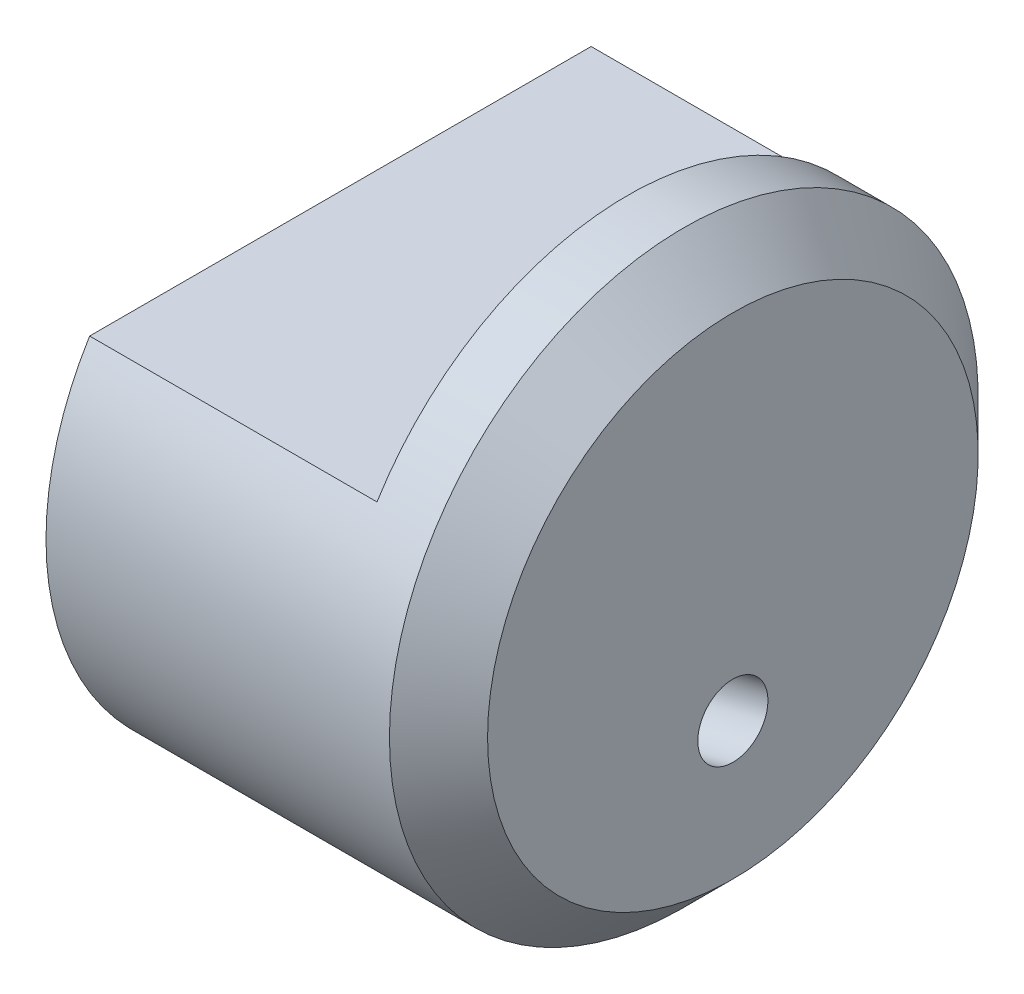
ISO-10303-21;
HEADER;
FILE_DESCRIPTION(('STEP AP214'),'2;1');
FILE_NAME('part.step','',(''),(''),'','','');
FILE_SCHEMA(('AUTOMOTIVE_DESIGN { 1 0 10303 214 1 1 1 1 }'));
ENDSEC;
DATA;
#1=APPLICATION_CONTEXT('core data for automotive mechanical design processes');
#2=APPLICATION_PROTOCOL_DEFINITION('international standard','automotive_design',2000,#1);
#3=PRODUCT_CONTEXT('',#1,'mechanical');
#4=PRODUCT('Part','Part','',(#3));
#5=PRODUCT_RELATED_PRODUCT_CATEGORY('part','',(#4));
#6=PRODUCT_DEFINITION_FORMATION('','',#4);
#7=PRODUCT_DEFINITION_CONTEXT('part definition',#1,'design');
#8=PRODUCT_DEFINITION('design','',#6,#7);
#9=PRODUCT_DEFINITION_SHAPE('','',#8);
#10=(LENGTH_UNIT() NAMED_UNIT(*) SI_UNIT(.MILLI.,.METRE.));
#11=(NAMED_UNIT(*) PLANE_ANGLE_UNIT() SI_UNIT($,.RADIAN.));
#12=(NAMED_UNIT(*) SI_UNIT($,.STERADIAN.) SOLID_ANGLE_UNIT());
#13=UNCERTAINTY_MEASURE_WITH_UNIT(LENGTH_MEASURE(1.E-05),#10,'distance_accuracy_value','');
#14=(GEOMETRIC_REPRESENTATION_CONTEXT(3) GLOBAL_UNCERTAINTY_ASSIGNED_CONTEXT((#13)) GLOBAL_UNIT_ASSIGNED_CONTEXT((#10,
#11,#12)) REPRESENTATION_CONTEXT('',''));
#15=CARTESIAN_POINT('',(0.,0.,0.));
#16=DIRECTION('',(0.,0.,1.));
#17=DIRECTION('',(1.,0.,0.));
#18=AXIS2_PLACEMENT_3D('',#15,#16,#17);
#19=CARTESIAN_POINT('',(0.,0.,0.));
#20=DIRECTION('',(1.,0.,0.));
#21=DIRECTION('',(0.,0.,-1.));
#22=AXIS2_PLACEMENT_3D('',#19,#20,#21);
#23=PLANE('',#22);
#24=CARTESIAN_POINT('',(0.,0.,0.));
#25=DIRECTION('',(-1.,0.,0.));
#26=DIRECTION('',(0.,0.,1.));
#27=AXIS2_PLACEMENT_3D('',#24,#25,#26);
#28=CIRCLE('',#27,3.5);
#29=CARTESIAN_POINT('',(0.,0.,3.5));
#30=VERTEX_POINT('',#29);
#31=EDGE_CURVE('E61',#30,#30,#28,.T.);
#32=ORIENTED_EDGE('',*,*,#31,.F.);
#33=EDGE_LOOP('',(#32));
#34=FACE_BOUND('',#33,.T.);
#35=CARTESIAN_POINT('',(0.,-1.54262279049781,0.));
#36=DIRECTION('',(1.,0.,0.));
#37=DIRECTION('',(0.,1.,0.));
#38=AXIS2_PLACEMENT_3D('',#35,#36,#37);
#39=ELLIPSE('',#38,0.514207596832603,0.5);
#40=CARTESIAN_POINT('',(0.,-1.02841519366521,0.));
#41=VERTEX_POINT('',#40);
#42=EDGE_CURVE('E34',#41,#41,#39,.F.);
#43=ORIENTED_EDGE('',*,*,#42,.T.);
#44=EDGE_LOOP('',(#43));
#45=FACE_BOUND('',#44,.T.);
#46=ADVANCED_FACE('F31',(#34,#45),#23,.T.);
#47=CARTESIAN_POINT('',(-0.700000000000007,0.,0.));
#48=DIRECTION('',(-1.,0.,0.));
#49=DIRECTION('',(0.,0.,1.));
#50=AXIS2_PLACEMENT_3D('',#47,#48,#49);
#51=CONICAL_SURFACE('',#50,4.2,0.785398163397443);
#52=ORIENTED_EDGE('',*,*,#31,.T.);
#53=EDGE_LOOP('',(#52));
#54=FACE_BOUND('',#53,.T.);
#55=CARTESIAN_POINT('',(-0.700000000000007,0.,0.));
#56=DIRECTION('',(-1.,0.,0.));
#57=DIRECTION('',(0.,0.,1.));
#58=AXIS2_PLACEMENT_3D('',#55,#56,#57);
#59=CIRCLE('',#58,4.2);
#60=CARTESIAN_POINT('',(-0.700000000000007,0.,4.2));
#61=VERTEX_POINT('',#60);
#62=EDGE_CURVE('E71',#61,#61,#59,.T.);
#63=ORIENTED_EDGE('',*,*,#62,.F.);
#64=EDGE_LOOP('',(#63));
#65=FACE_BOUND('',#64,.T.);
#66=ADVANCED_FACE('F83',(#54,#65),#51,.T.);
#67=CARTESIAN_POINT('',(-1.5,0.,0.));
#68=DIRECTION('',(-1.,0.,0.));
#69=DIRECTION('',(0.,0.,1.));
#70=AXIS2_PLACEMENT_3D('',#67,#68,#69);
#71=CYLINDRICAL_SURFACE('',#70,4.2);
#72=DIRECTION('',(-1.,0.,0.));
#73=VECTOR('',#72,1.);
#74=CARTESIAN_POINT('',(-1.5,2.2,3.57770876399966));
#75=LINE('',#74,#73);
#76=CARTESIAN_POINT('',(-5.6,2.2,3.57770876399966));
#77=VERTEX_POINT('',#76);
#78=CARTESIAN_POINT('',(-1.5,2.2,3.57770876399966));
#79=VERTEX_POINT('',#78);
#80=EDGE_CURVE('E51',#77,#79,#75,.F.);
#81=ORIENTED_EDGE('',*,*,#80,.F.);
#82=CARTESIAN_POINT('',(-5.6,0.,0.));
#83=DIRECTION('',(-1.,0.,0.));
#84=DIRECTION('',(0.,0.,1.));
#85=AXIS2_PLACEMENT_3D('',#82,#83,#84);
#86=CIRCLE('',#85,4.2);
#87=CARTESIAN_POINT('',(-5.6,2.2,-3.57770876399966));
#88=VERTEX_POINT('',#87);
#89=EDGE_CURVE('E66',#88,#77,#86,.T.);
#90=ORIENTED_EDGE('',*,*,#89,.F.);
#91=DIRECTION('',(-1.,0.,0.));
#92=VECTOR('',#91,1.);
#93=CARTESIAN_POINT('',(-1.5,2.2,-3.57770876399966));
#94=LINE('',#93,#92);
#95=CARTESIAN_POINT('',(-1.5,2.2,-3.57770876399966));
#96=VERTEX_POINT('',#95);
#97=EDGE_CURVE('E46',#96,#88,#94,.T.);
#98=ORIENTED_EDGE('',*,*,#97,.F.);
#99=CARTESIAN_POINT('',(-1.5,0.,0.));
#100=DIRECTION('',(-1.,0.,0.));
#101=DIRECTION('',(0.,0.,1.));
#102=AXIS2_PLACEMENT_3D('',#99,#100,#101);
#103=CIRCLE('',#102,4.2);
#104=EDGE_CURVE('E11',#96,#79,#103,.F.);
#105=ORIENTED_EDGE('',*,*,#104,.T.);
#106=EDGE_LOOP('',(#81,#90,#98,#105));
#107=FACE_BOUND('',#106,.T.);
#108=ORIENTED_EDGE('',*,*,#62,.T.);
#109=EDGE_LOOP('',(#108));
#110=FACE_BOUND('',#109,.T.);
#111=ADVANCED_FACE('F64',(#107,#110),#71,.T.);
#112=CARTESIAN_POINT('',(-5.6,-4.2,0.));
#113=DIRECTION('',(-1.,0.,0.));
#114=DIRECTION('',(0.,0.,1.));
#115=AXIS2_PLACEMENT_3D('',#112,#113,#114);
#116=PLANE('',#115);
#117=DIRECTION('',(0.,0.,1.));
#118=VECTOR('',#117,1.);
#119=CARTESIAN_POINT('',(-5.6,2.2,0.));
#120=LINE('',#119,#118);
#121=EDGE_CURVE('E39',#88,#77,#120,.T.);
#122=ORIENTED_EDGE('',*,*,#121,.F.);
#123=ORIENTED_EDGE('',*,*,#89,.T.);
#124=EDGE_LOOP('',(#122,#123));
#125=FACE_BOUND('',#124,.T.);
#126=CARTESIAN_POINT('',(-5.6,0.,0.));
#127=DIRECTION('',(-1.,0.,0.));
#128=DIRECTION('',(0.,0.,1.));
#129=AXIS2_PLACEMENT_3D('',#126,#127,#128);
#130=CIRCLE('',#129,0.750000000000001);
#131=CARTESIAN_POINT('',(-5.6,0.,0.750000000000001));
#132=VERTEX_POINT('',#131);
#133=EDGE_CURVE('E72',#132,#132,#130,.T.);
#134=ORIENTED_EDGE('',*,*,#133,.F.);
#135=EDGE_LOOP('',(#134));
#136=FACE_BOUND('',#135,.T.);
#137=ADVANCED_FACE('F69',(#125,#136),#116,.T.);
#138=CARTESIAN_POINT('',(-1.5,0.,0.));
#139=DIRECTION('',(-1.,0.,0.));
#140=DIRECTION('',(0.,0.,1.));
#141=AXIS2_PLACEMENT_3D('',#138,#139,#140);
#142=CYLINDRICAL_SURFACE('',#141,0.750000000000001);
#143=ORIENTED_EDGE('',*,*,#133,.T.);
#144=EDGE_LOOP('',(#143));
#145=FACE_BOUND('',#144,.T.);
#146=CARTESIAN_POINT('',(-1.5,0.,0.));
#147=DIRECTION('',(-1.,0.,0.));
#148=DIRECTION('',(0.,0.,1.));
#149=AXIS2_PLACEMENT_3D('',#146,#147,#148);
#150=CIRCLE('',#149,0.750000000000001);
#151=CARTESIAN_POINT('',(-1.5,0.,0.750000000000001));
#152=VERTEX_POINT('',#151);
#153=EDGE_CURVE('E67',#152,#152,#150,.T.);
#154=ORIENTED_EDGE('',*,*,#153,.F.);
#155=EDGE_LOOP('',(#154));
#156=FACE_BOUND('',#155,.T.);
#157=ADVANCED_FACE('F104',(#145,#156),#142,.F.);
#158=CARTESIAN_POINT('',(-1.5,-0.750000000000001,0.));
#159=DIRECTION('',(-1.,0.,0.));
#160=DIRECTION('',(0.,0.,1.));
#161=AXIS2_PLACEMENT_3D('',#158,#159,#160);
#162=PLANE('',#161);
#163=ORIENTED_EDGE('',*,*,#153,.T.);
#164=EDGE_LOOP('',(#163));
#165=FACE_BOUND('',#164,.T.);
#166=ADVANCED_FACE('F102',(#165),#162,.T.);
#167=CARTESIAN_POINT('',(-1.5,2.2,-4.60626173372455));
#168=DIRECTION('',(0.,-1.,0.));
#169=DIRECTION('',(0.,0.,-1.));
#170=AXIS2_PLACEMENT_3D('',#167,#168,#169);
#171=PLANE('',#170);
#172=ORIENTED_EDGE('',*,*,#80,.T.);
#173=DIRECTION('',(0.,0.,1.));
#174=VECTOR('',#173,1.);
#175=CARTESIAN_POINT('',(-1.5,2.2,-4.60626173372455));
#176=LINE('',#175,#174);
#177=EDGE_CURVE('E91',#96,#79,#176,.T.);
#178=ORIENTED_EDGE('',*,*,#177,.F.);
#179=ORIENTED_EDGE('',*,*,#97,.T.);
#180=ORIENTED_EDGE('',*,*,#121,.T.);
#181=EDGE_LOOP('',(#172,#178,#179,#180));
#182=FACE_BOUND('',#181,.T.);
#183=ADVANCED_FACE('F57',(#182),#171,.F.);
#184=CARTESIAN_POINT('',(-1.5,2.2,4.60626173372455));
#185=DIRECTION('',(-1.,0.,0.));
#186=DIRECTION('',(0.,0.,1.));
#187=AXIS2_PLACEMENT_3D('',#184,#185,#186);
#188=PLANE('',#187);
#189=ORIENTED_EDGE('',*,*,#177,.T.);
#190=ORIENTED_EDGE('',*,*,#104,.F.);
#191=EDGE_LOOP('',(#189,#190));
#192=FACE_BOUND('',#191,.T.);
#193=ADVANCED_FACE('F141',(#192),#188,.T.);
#194=CARTESIAN_POINT('',(-4.60891854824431,-2.6491262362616,0.));
#195=DIRECTION('',(0.972369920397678,0.233445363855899,0.));
#196=DIRECTION('',(-0.233445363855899,0.972369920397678,0.));
#197=AXIS2_PLACEMENT_3D('',#194,#195,#196);
#198=CYLINDRICAL_SURFACE('',#197,0.5);
#199=ORIENTED_EDGE('',*,*,#42,.F.);
#200=EDGE_LOOP('',(#199));
#201=FACE_BOUND('',#200,.T.);
#202=CARTESIAN_POINT('',(-4.60891854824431,-2.6491262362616,0.));
#203=DIRECTION('',(-0.972369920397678,-0.233445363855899,0.));
#204=DIRECTION('',(0.233445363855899,-0.972369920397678,0.));
#205=AXIS2_PLACEMENT_3D('',#202,#203,#204);
#206=CIRCLE('',#205,0.5);
#207=CARTESIAN_POINT('',(-4.49219586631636,-3.13531119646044,0.));
#208=VERTEX_POINT('',#207);
#209=EDGE_CURVE('E92',#208,#208,#206,.T.);
#210=ORIENTED_EDGE('',*,*,#209,.T.);
#211=EDGE_LOOP('',(#210));
#212=FACE_BOUND('',#211,.T.);
#213=ADVANCED_FACE('F149',(#201,#212),#198,.F.);
#214=CARTESIAN_POINT('',(-4.60891854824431,-2.6491262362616,0.));
#215=DIRECTION('',(-0.972369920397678,-0.233445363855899,0.));
#216=DIRECTION('',(0.233445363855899,-0.972369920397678,0.));
#217=AXIS2_PLACEMENT_3D('',#214,#215,#216);
#218=PLANE('',#217);
#219=ORIENTED_EDGE('',*,*,#209,.F.);
#220=EDGE_LOOP('',(#219));
#221=FACE_BOUND('',#220,.T.);
#222=ADVANCED_FACE('F164',(#221),#218,.F.);
#223=CLOSED_SHELL('',(#46,#66,#111,#137,#157,#166,#183,#193,#213,#222));
#224=MANIFOLD_SOLID_BREP('B2',#223);
#225=ADVANCED_BREP_SHAPE_REPRESENTATION('',(#18,#224),#14);
#226=SHAPE_DEFINITION_REPRESENTATION(#9,#225);
ENDSEC;
END-ISO-10303-21;
